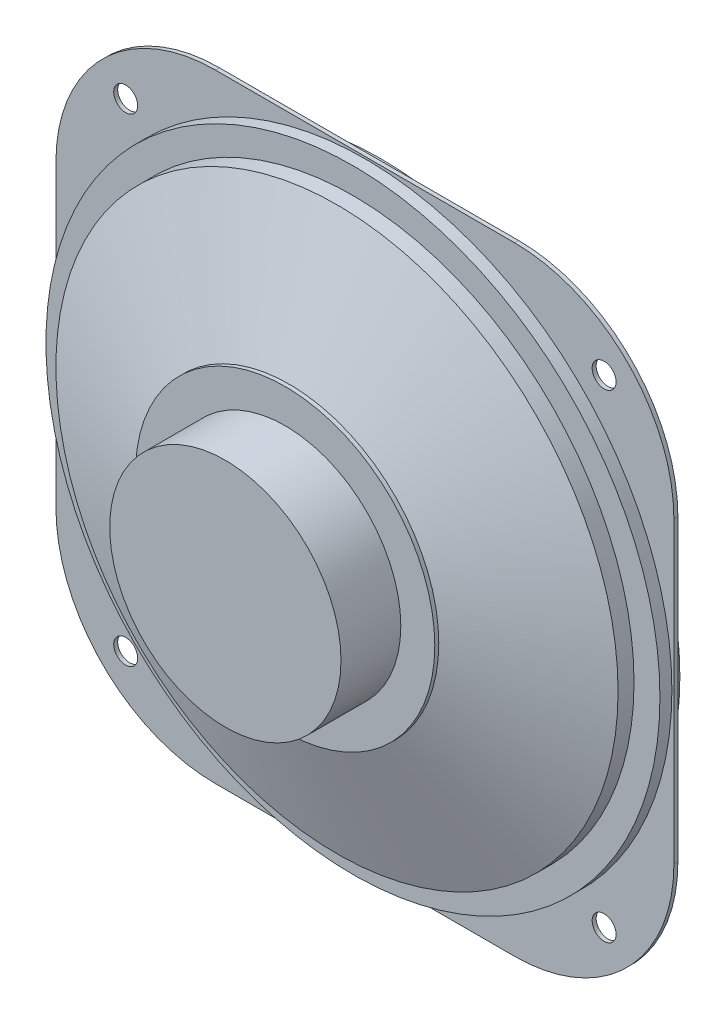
from build123d import *

# Parameters (mm, degrees)
ESQUISSE1_R             = 1.5
ESQUISSE1_R_2           = 38.5
BOSS_EXTRU_1_DEPTH      = 0.5
ESQUISSE2_R             = 38.5
ESQUISSE2_R_2           = 35.25
BOSS_EXTRU_2_DEPTH      = 1.5
ESQUISSE3_R             = 35.25
ESQUISSE3_R_2           = 18
BOSS_EXTRU_3_DEPTH      = 8
CHANFREIN3_SIZE         = 6
CHANFREIN3_SIZE2        = 16.484864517
ESQUISSE5_R             = 18.765135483
ESQUISSE5_R_2           = 14.502651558
BOSS_EXTRU_4_DEPTH      = 0.5
ESQUISSE6_R             = 14.502651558
BOSS_EXTRU_5_DEPTH      = 7.5
BOSS_EXTRU_7_DEPTH      = 1.5
BOSS_EXTRU_7_DEPTH_BACK = 1.9
ESQUISSE7_R             = 37.5
ESQUISSE7_R_2           = 35.5
CHANFREIN4_SIZE         = 6
CHANFREIN4_SIZE2        = 16.484864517


with BuildPart() as part:
    # Esquisse1 → Boss.-Extru.1 (new body)
    with BuildSketch(Plane.XY):
        with BuildLine():
            Line((18.75, 38.75), (-18.75, 38.75))
            ThreePointArc((-18.75, 38.75), (-32.892135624, 32.892135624), (-38.75, 18.75))
            Line((-38.75, 18.75), (-38.75, -18.75))
            ThreePointArc((-38.75, -18.75), (-32.892135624, -32.892135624), (-18.75, -38.75))
            Line((-18.75, -38.75), (18.75, -38.75))
            ThreePointArc((18.75, -38.75), (32.892135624, -32.892135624), (38.75, -18.75))
            Line((38.75, -18.75), (38.75, 18.75))
            ThreePointArc((38.75, 18.75), (32.892135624, 32.892135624), (18.75, 38.75))
        make_face()
        with Locations((-30, 30)):
            Circle(ESQUISSE1_R, mode=Mode.SUBTRACT)
        with Locations((30, 30)):
            Circle(ESQUISSE1_R, mode=Mode.SUBTRACT)
        with Locations((30, -30)):
            Circle(ESQUISSE1_R, mode=Mode.SUBTRACT)
        with Locations((-30, -30)):
            Circle(ESQUISSE1_R, mode=Mode.SUBTRACT)
        Circle(ESQUISSE1_R_2, mode=Mode.SUBTRACT)
    extrude(amount=BOSS_EXTRU_1_DEPTH)


with BuildPart() as body_2:
    # Esquisse2 → Boss.-Extru.2 (new body)
    with BuildSketch(Plane.XY.offset(0.5)):
        Circle(ESQUISSE2_R)
        Circle(ESQUISSE2_R_2, mode=Mode.SUBTRACT)
    extrude(amount=BOSS_EXTRU_2_DEPTH)

    # Esquisse7 → Boss.-Extru.7 (add, two sides: drawn at the far end of the back side and taken through both)
    with BuildSketch(Plane(origin=(0, 0, 0), x_dir=(-1, 0, 0), z_dir=(0, 0, -1)).offset(-BOSS_EXTRU_7_DEPTH_BACK)):
        Circle(ESQUISSE7_R)
        Circle(ESQUISSE7_R_2, mode=Mode.SUBTRACT)
    extrude(amount=BOSS_EXTRU_7_DEPTH + BOSS_EXTRU_7_DEPTH_BACK)


with BuildPart() as body_3:
    # Esquisse3 → Boss.-Extru.3 (new body)
    with BuildSketch(Plane.XY.offset(2)):
        Circle(ESQUISSE3_R)
        Circle(ESQUISSE3_R_2, mode=Mode.SUBTRACT)
    extrude(amount=BOSS_EXTRU_3_DEPTH)

    # Chanfrein3
    chanfrein3_edges = [body_3.edges().sort_by_distance(p)[0] for p in [
        (-35.25, 0, 10),
    ]]
    chanfrein3_side = [body_3.faces().sort_by_distance(p)[0] for p in [
        (-35.25, 0, 6),
    ]]
    chamfer(chanfrein3_edges, length=CHANFREIN3_SIZE, length2=CHANFREIN3_SIZE2, reference=chanfrein3_side[0])

    # Esquisse5 → Boss.-Extru.4 (add)
    with BuildSketch(Plane.XY.offset(10)):
        Circle(ESQUISSE5_R)
        Circle(ESQUISSE5_R_2, mode=Mode.SUBTRACT)
    extrude(amount=BOSS_EXTRU_4_DEPTH)

    # Chanfrein4
    chanfrein4_edges = [body_3.edges().sort_by_distance(p)[0] for p in [
        (-18, 0, 2),
    ]]
    chanfrein4_side = [body_3.faces().sort_by_distance(p)[0] for p in [
        (-18, 0, 6),
    ]]
    chamfer(chanfrein4_edges, length=CHANFREIN4_SIZE, length2=CHANFREIN4_SIZE2, reference=chanfrein4_side[0])


with BuildPart() as body_4:
    # Esquisse6 → Boss.-Extru.5 (new body)
    with BuildSketch(Plane.XY.offset(10.5)):
        Circle(ESQUISSE6_R)
    extrude(amount=BOSS_EXTRU_5_DEPTH)


solid = Compound([part.part, body_2.part, body_3.part, body_4.part])
